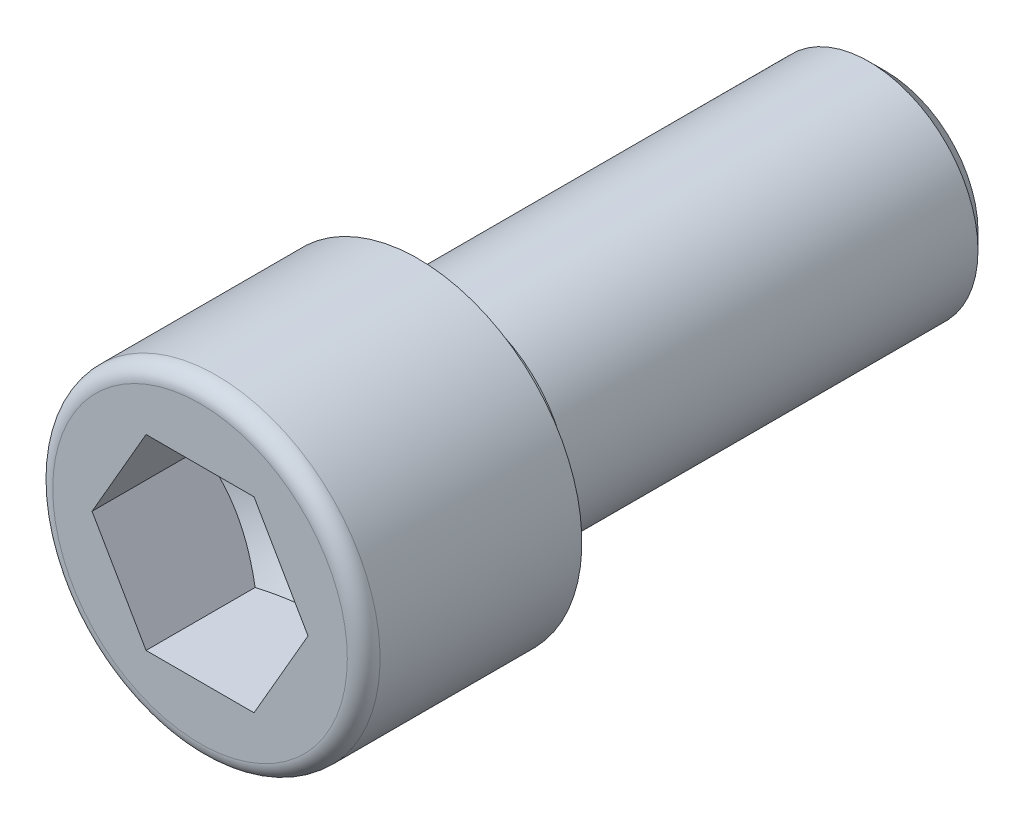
ISO-10303-21;
HEADER;
FILE_DESCRIPTION(('STEP AP214'),'2;1');
FILE_NAME('part.step','',(''),(''),'','','');
FILE_SCHEMA(('AUTOMOTIVE_DESIGN { 1 0 10303 214 1 1 1 1 }'));
ENDSEC;
DATA;
#1=APPLICATION_CONTEXT('core data for automotive mechanical design processes');
#2=APPLICATION_PROTOCOL_DEFINITION('international standard','automotive_design',2000,#1);
#3=PRODUCT_CONTEXT('',#1,'mechanical');
#4=PRODUCT('Part','Part','',(#3));
#5=PRODUCT_RELATED_PRODUCT_CATEGORY('part','',(#4));
#6=PRODUCT_DEFINITION_FORMATION('','',#4);
#7=PRODUCT_DEFINITION_CONTEXT('part definition',#1,'design');
#8=PRODUCT_DEFINITION('design','',#6,#7);
#9=PRODUCT_DEFINITION_SHAPE('','',#8);
#10=(LENGTH_UNIT() NAMED_UNIT(*) SI_UNIT(.MILLI.,.METRE.));
#11=(NAMED_UNIT(*) PLANE_ANGLE_UNIT() SI_UNIT($,.RADIAN.));
#12=(NAMED_UNIT(*) SI_UNIT($,.STERADIAN.) SOLID_ANGLE_UNIT());
#13=UNCERTAINTY_MEASURE_WITH_UNIT(LENGTH_MEASURE(1.E-05),#10,'distance_accuracy_value','');
#14=(GEOMETRIC_REPRESENTATION_CONTEXT(3) GLOBAL_UNCERTAINTY_ASSIGNED_CONTEXT((#13)) GLOBAL_UNIT_ASSIGNED_CONTEXT((#10,
#11,#12)) REPRESENTATION_CONTEXT('',''));
#15=CARTESIAN_POINT('',(0.,0.,0.));
#16=DIRECTION('',(0.,0.,1.));
#17=DIRECTION('',(1.,0.,0.));
#18=AXIS2_PLACEMENT_3D('',#15,#16,#17);
#19=CARTESIAN_POINT('',(0.,0.,7.02399999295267));
#20=DIRECTION('',(0.,0.,1.));
#21=DIRECTION('',(1.,0.,0.));
#22=AXIS2_PLACEMENT_3D('',#19,#20,#21);
#23=CONICAL_SURFACE('',#22,6.96976919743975,1.04719754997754);
#24=CARTESIAN_POINT('',(6.92820000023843,1.63961100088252E-09,7.00000000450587));
#25=CARTESIAN_POINT('',(6.85205600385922,0.13188527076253,6.95604672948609));
#26=CARTESIAN_POINT('',(6.77562810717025,0.264262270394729,6.9140883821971));
#27=CARTESIAN_POINT('',(6.62215164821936,0.53009129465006,6.83471096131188));
#28=CARTESIAN_POINT('',(6.54510283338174,0.663543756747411,6.79729384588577));
#29=CARTESIAN_POINT('',(6.31272282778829,1.06603773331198,6.6925888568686));
#30=CARTESIAN_POINT('',(6.15647438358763,1.3366679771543,6.63303478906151));
#31=CARTESIAN_POINT('',(5.92265144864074,1.74166118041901,6.5632022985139));
#32=CARTESIAN_POINT('',(5.84577552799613,1.87481418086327,6.54330937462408));
#33=CARTESIAN_POINT('',(5.69167637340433,2.14172174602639,6.50995264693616));
#34=CARTESIAN_POINT('',(5.61445317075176,2.27547625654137,6.49648827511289));
#35=CARTESIAN_POINT('',(5.45987268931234,2.5432175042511,6.47633179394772));
#36=CARTESIAN_POINT('',(5.38251566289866,2.67720380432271,6.46963199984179));
#37=CARTESIAN_POINT('',(5.22773447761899,2.9452926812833,6.46314114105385));
#38=CARTESIAN_POINT('',(5.15031032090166,3.07939525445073,6.4633498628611));
#39=CARTESIAN_POINT('',(4.93820667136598,3.44676955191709,6.47341714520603));
#40=CARTESIAN_POINT('',(4.80359665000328,3.67992094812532,6.49030895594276));
#41=CARTESIAN_POINT('',(4.53527065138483,4.14467521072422,6.54386725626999));
#42=CARTESIAN_POINT('',(4.40155561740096,4.37627644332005,6.58055204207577));
#43=CARTESIAN_POINT('',(4.13268985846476,4.8419655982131,6.67225109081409));
#44=CARTESIAN_POINT('',(3.99757304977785,5.07599477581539,6.72765377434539));
#45=CARTESIAN_POINT('',(3.72935411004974,5.54056360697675,6.8533946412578));
#46=CARTESIAN_POINT('',(3.59624854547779,5.77110920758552,6.92370329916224));
#47=CARTESIAN_POINT('',(3.46410000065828,5.99999720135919,7.00000000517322));
#48=B_SPLINE_CURVE_WITH_KNOTS('',3,(#24,#25,#26,#27,#28,#29,#30,#31,#32,#33,#34,#35,#36,#37,#38,
#39,#40,#41,#42,#43,#44,#45,#46,#47),.UNSPECIFIED.,.F.,.F.,(4,2,2,2,2,2,2,2,2,2,2,4),(0.,
0.475474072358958,0.951152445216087,1.90448541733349,2.36947707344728,2.8344276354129,
3.29884940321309,3.76325681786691,4.57165712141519,5.38080597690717,6.20789787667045,
7.03336654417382),.UNSPECIFIED.);
#49=CARTESIAN_POINT('',(6.92819999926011,0.,7.00000000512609));
#50=VERTEX_POINT('',#49);
#51=CARTESIAN_POINT('',(3.46409999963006,5.99999720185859,7.00000000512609));
#52=VERTEX_POINT('',#51);
#53=EDGE_CURVE('E118',#50,#52,#48,.T.);
#54=ORIENTED_EDGE('',*,*,#53,.T.);
#55=CARTESIAN_POINT('',(3.46409999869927,5.99999720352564,7.00000000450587));
#56=CARTESIAN_POINT('',(3.1797317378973,5.9999972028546,6.91790136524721));
#57=CARTESIAN_POINT('',(2.89311387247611,5.99999720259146,6.84273774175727));
#58=CARTESIAN_POINT('',(2.31522223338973,5.99999720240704,6.70989536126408));
#59=CARTESIAN_POINT('',(2.02393954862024,5.99999720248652,6.65225572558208));
#60=CARTESIAN_POINT('',(1.44464263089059,5.99999720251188,6.55956421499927));
#61=CARTESIAN_POINT('',(1.15670995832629,5.99999720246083,6.52401814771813));
#62=CARTESIAN_POINT('',(0.57918342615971,5.99999720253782,6.47629966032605));
#63=CARTESIAN_POINT('',(0.28959171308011,5.99999720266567,6.46410186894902));
#64=CARTESIAN_POINT('',(-0.28959171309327,5.99999720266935,6.46410186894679));
#65=CARTESIAN_POINT('',(-0.579183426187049,5.99999720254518,6.47629966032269));
#66=CARTESIAN_POINT('',(-1.15670995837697,5.99999720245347,6.52401814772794));
#67=CARTESIAN_POINT('',(-1.44464263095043,5.99999720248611,6.55956421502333));
#68=CARTESIAN_POINT('',(-2.02393954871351,5.9999972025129,6.65225572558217));
#69=CARTESIAN_POINT('',(-2.31522223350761,5.99999720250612,6.70989536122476));
#70=CARTESIAN_POINT('',(-2.89311387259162,5.99999720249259,6.8427377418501));
#71=CARTESIAN_POINT('',(-3.17973173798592,5.99999720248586,6.91790136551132));
#72=CARTESIAN_POINT('',(-3.46409999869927,5.99999720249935,7.00000000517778));
#73=B_SPLINE_CURVE_WITH_KNOTS('',3,(#55,#56,#57,#58,#59,#60,#61,#62,#63,#64,#65,#66,#67,#68,#69,
#70,#71,#72),.UNSPECIFIED.,.F.,.F.,(4,2,2,2,2,2,2,2,4),(0.,0.888219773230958,1.77840812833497,
2.64789134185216,3.51642919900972,4.38496705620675,5.25445026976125,6.14463862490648,
7.03285839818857),.UNSPECIFIED.);
#74=CARTESIAN_POINT('',(-3.46409999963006,5.99999720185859,7.00000000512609));
#75=VERTEX_POINT('',#74);
#76=EDGE_CURVE('E139',#52,#75,#73,.T.);
#77=ORIENTED_EDGE('',*,*,#76,.T.);
#78=CARTESIAN_POINT('',(-3.46410000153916,5.99999720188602,7.00000000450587));
#79=CARTESIAN_POINT('',(-3.54024399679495,5.8681119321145,6.95604672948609));
#80=CARTESIAN_POINT('',(-3.61667189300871,5.73573493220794,6.9140883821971));
#81=CARTESIAN_POINT('',(-3.77014835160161,5.46990590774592,6.83471096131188));
#82=CARTESIAN_POINT('',(-3.84719716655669,5.33645344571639,6.79729384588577));
#83=CARTESIAN_POINT('',(-4.0795771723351,4.93395946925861,6.6925888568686));
#84=CARTESIAN_POINT('',(-4.2358256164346,4.66332922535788,6.63303478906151));
#85=CARTESIAN_POINT('',(-4.46964855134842,4.25833602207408,6.5632022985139));
#86=CARTESIAN_POINT('',(-4.54652447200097,4.1251830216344,6.54330937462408));
#87=CARTESIAN_POINT('',(-4.70062362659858,3.85827545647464,6.50995264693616));
#88=CARTESIAN_POINT('',(-4.77784682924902,3.72452094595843,6.49648827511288));
#89=CARTESIAN_POINT('',(-4.93242731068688,3.4567796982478,6.47633179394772));
#90=CARTESIAN_POINT('',(-5.00978433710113,3.32279339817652,6.46963199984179));
#91=CARTESIAN_POINT('',(-5.16456552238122,3.05470452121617,6.46314114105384));
#92=CARTESIAN_POINT('',(-5.24198967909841,2.92060194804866,6.46334986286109));
#93=CARTESIAN_POINT('',(-5.4540933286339,2.55322765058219,6.47341714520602));
#94=CARTESIAN_POINT('',(-5.58870334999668,2.32007625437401,6.49030895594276));
#95=CARTESIAN_POINT('',(-5.85702934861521,1.85532199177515,6.54386725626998));
#96=CARTESIAN_POINT('',(-5.99074438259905,1.6237207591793,6.58055204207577));
#97=CARTESIAN_POINT('',(-6.25961014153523,1.15803160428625,6.67225109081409));
#98=CARTESIAN_POINT('',(-6.39472695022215,0.924002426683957,6.72765377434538));
#99=CARTESIAN_POINT('',(-6.66294588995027,0.459433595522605,6.8533946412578));
#100=CARTESIAN_POINT('',(-6.79605145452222,0.228887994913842,6.92370329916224));
#101=CARTESIAN_POINT('',(-6.92819999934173,1.14016237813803E-09,7.00000000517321));
#102=B_SPLINE_CURVE_WITH_KNOTS('',3,(#78,#79,#80,#81,#82,#83,#84,#85,#86,#87,#88,#89,#90,#91,
#92,#93,#94,#95,#96,#97,#98,#99,#100,#101),.UNSPECIFIED.,.F.,.F.,(4,2,2,2,2,2,2,2,2,2,2,4),(0.,
0.475474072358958,0.951152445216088,1.90448541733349,2.36947707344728,2.8344276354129,
3.29884940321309,3.76325681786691,4.57165712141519,5.38080597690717,6.20789787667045,
7.03336654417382),.UNSPECIFIED.);
#103=CARTESIAN_POINT('',(-6.92819999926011,0.,7.00000000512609));
#104=VERTEX_POINT('',#103);
#105=EDGE_CURVE('E146',#75,#104,#102,.T.);
#106=ORIENTED_EDGE('',*,*,#105,.T.);
#107=CARTESIAN_POINT('',(-6.92820000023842,-1.63960875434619E-09,7.00000000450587));
#108=CARTESIAN_POINT('',(-6.85205600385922,-0.131885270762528,6.95604672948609));
#109=CARTESIAN_POINT('',(-6.77562810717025,-0.264262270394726,6.9140883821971));
#110=CARTESIAN_POINT('',(-6.62215164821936,-0.530091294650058,6.83471096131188));
#111=CARTESIAN_POINT('',(-6.54510283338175,-0.66354375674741,6.79729384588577));
#112=CARTESIAN_POINT('',(-6.31272282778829,-1.06603773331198,6.6925888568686));
#113=CARTESIAN_POINT('',(-6.15647438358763,-1.3366679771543,6.63303478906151));
#114=CARTESIAN_POINT('',(-5.92265144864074,-1.74166118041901,6.5632022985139));
#115=CARTESIAN_POINT('',(-5.84577552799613,-1.87481418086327,6.54330937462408));
#116=CARTESIAN_POINT('',(-5.69167637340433,-2.14172174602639,6.50995264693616));
#117=CARTESIAN_POINT('',(-5.61445317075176,-2.27547625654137,6.49648827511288));
#118=CARTESIAN_POINT('',(-5.45987268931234,-2.5432175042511,6.47633179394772));
#119=CARTESIAN_POINT('',(-5.38251566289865,-2.67720380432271,6.46963199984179));
#120=CARTESIAN_POINT('',(-5.22773447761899,-2.9452926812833,6.46314114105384));
#121=CARTESIAN_POINT('',(-5.15031032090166,-3.07939525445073,6.46334986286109));
#122=CARTESIAN_POINT('',(-4.93820667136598,-3.44676955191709,6.47341714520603));
#123=CARTESIAN_POINT('',(-4.80359665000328,-3.67992094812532,6.49030895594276));
#124=CARTESIAN_POINT('',(-4.53527065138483,-4.14467521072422,6.54386725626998));
#125=CARTESIAN_POINT('',(-4.40155561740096,-4.37627644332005,6.58055204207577));
#126=CARTESIAN_POINT('',(-4.13268985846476,-4.8419655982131,6.67225109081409));
#127=CARTESIAN_POINT('',(-3.99757304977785,-5.07599477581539,6.72765377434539));
#128=CARTESIAN_POINT('',(-3.72935411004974,-5.54056360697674,6.8533946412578));
#129=CARTESIAN_POINT('',(-3.59624854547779,-5.77110920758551,6.92370329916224));
#130=CARTESIAN_POINT('',(-3.46410000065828,-5.99999720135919,7.00000000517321));
#131=B_SPLINE_CURVE_WITH_KNOTS('',3,(#107,#108,#109,#110,#111,#112,#113,#114,#115,#116,#117,
#118,#119,#120,#121,#122,#123,#124,#125,#126,#127,#128,#129,#130),.UNSPECIFIED.,.F.,.F.,(4,2,2,
2,2,2,2,2,2,2,2,4),(0.,0.475474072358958,0.951152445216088,1.90448541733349,2.36947707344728,
2.8344276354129,3.29884940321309,3.76325681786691,4.57165712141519,5.38080597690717,
6.20789787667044,7.03336654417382),.UNSPECIFIED.);
#132=CARTESIAN_POINT('',(-3.46409999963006,-5.99999720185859,7.00000000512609));
#133=VERTEX_POINT('',#132);
#134=EDGE_CURVE('E90',#104,#133,#131,.T.);
#135=ORIENTED_EDGE('',*,*,#134,.T.);
#136=CARTESIAN_POINT('',(-3.46409999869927,-5.99999720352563,7.00000000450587));
#137=CARTESIAN_POINT('',(-3.1797317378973,-5.9999972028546,6.91790136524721));
#138=CARTESIAN_POINT('',(-2.89311387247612,-5.99999720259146,6.84273774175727));
#139=CARTESIAN_POINT('',(-2.31522223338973,-5.99999720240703,6.70989536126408));
#140=CARTESIAN_POINT('',(-2.02393954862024,-5.99999720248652,6.65225572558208));
#141=CARTESIAN_POINT('',(-1.4446426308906,-5.99999720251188,6.55956421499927));
#142=CARTESIAN_POINT('',(-1.15670995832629,-5.99999720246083,6.52401814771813));
#143=CARTESIAN_POINT('',(-0.57918342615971,-5.99999720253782,6.47629966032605));
#144=CARTESIAN_POINT('',(-0.28959171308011,-5.99999720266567,6.46410186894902));
#145=CARTESIAN_POINT('',(0.28959171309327,-5.99999720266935,6.46410186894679));
#146=CARTESIAN_POINT('',(0.579183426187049,-5.99999720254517,6.47629966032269));
#147=CARTESIAN_POINT('',(1.15670995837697,-5.99999720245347,6.52401814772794));
#148=CARTESIAN_POINT('',(1.44464263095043,-5.99999720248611,6.55956421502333));
#149=CARTESIAN_POINT('',(2.02393954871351,-5.9999972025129,6.65225572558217));
#150=CARTESIAN_POINT('',(2.31522223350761,-5.99999720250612,6.70989536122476));
#151=CARTESIAN_POINT('',(2.89311387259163,-5.99999720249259,6.8427377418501));
#152=CARTESIAN_POINT('',(3.17973173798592,-5.99999720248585,6.91790136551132));
#153=CARTESIAN_POINT('',(3.46409999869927,-5.99999720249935,7.00000000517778));
#154=B_SPLINE_CURVE_WITH_KNOTS('',3,(#136,#137,#138,#139,#140,#141,#142,#143,#144,#145,#146,
#147,#148,#149,#150,#151,#152,#153),.UNSPECIFIED.,.F.,.F.,(4,2,2,2,2,2,2,2,4),(0.,
0.888219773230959,1.77840812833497,2.64789134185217,3.51642919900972,4.38496705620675,
5.25445026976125,6.14463862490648,7.03285839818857),.UNSPECIFIED.);
#155=CARTESIAN_POINT('',(3.46409999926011,-5.99999720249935,7.00000000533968));
#156=VERTEX_POINT('',#155);
#157=EDGE_CURVE('E82',#133,#156,#154,.T.);
#158=ORIENTED_EDGE('',*,*,#157,.T.);
#159=CARTESIAN_POINT('',(3.46410000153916,-5.99999720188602,7.00000000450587));
#160=CARTESIAN_POINT('',(3.54024399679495,-5.8681119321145,6.95604672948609));
#161=CARTESIAN_POINT('',(3.61667189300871,-5.73573493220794,6.9140883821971));
#162=CARTESIAN_POINT('',(3.77014835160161,-5.46990590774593,6.83471096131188));
#163=CARTESIAN_POINT('',(3.84719716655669,-5.3364534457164,6.79729384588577));
#164=CARTESIAN_POINT('',(4.0795771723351,-4.93395946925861,6.6925888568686));
#165=CARTESIAN_POINT('',(4.2358256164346,-4.66332922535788,6.63303478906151));
#166=CARTESIAN_POINT('',(4.46964855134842,-4.25833602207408,6.5632022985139));
#167=CARTESIAN_POINT('',(4.54652447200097,-4.1251830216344,6.54330937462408));
#168=CARTESIAN_POINT('',(4.70062362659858,-3.85827545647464,6.50995264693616));
#169=CARTESIAN_POINT('',(4.77784682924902,-3.72452094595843,6.49648827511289));
#170=CARTESIAN_POINT('',(4.93242731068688,-3.4567796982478,6.47633179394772));
#171=CARTESIAN_POINT('',(5.00978433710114,-3.32279339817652,6.46963199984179));
#172=CARTESIAN_POINT('',(5.16456552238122,-3.05470452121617,6.46314114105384));
#173=CARTESIAN_POINT('',(5.24198967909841,-2.92060194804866,6.46334986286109));
#174=CARTESIAN_POINT('',(5.4540933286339,-2.55322765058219,6.47341714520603));
#175=CARTESIAN_POINT('',(5.58870334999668,-2.32007625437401,6.49030895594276));
#176=CARTESIAN_POINT('',(5.85702934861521,-1.85532199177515,6.54386725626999));
#177=CARTESIAN_POINT('',(5.99074438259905,-1.6237207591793,6.58055204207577));
#178=CARTESIAN_POINT('',(6.25961014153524,-1.15803160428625,6.67225109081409));
#179=CARTESIAN_POINT('',(6.39472695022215,-0.924002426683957,6.72765377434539));
#180=CARTESIAN_POINT('',(6.66294588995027,-0.459433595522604,6.8533946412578));
#181=CARTESIAN_POINT('',(6.79605145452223,-0.228887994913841,6.92370329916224));
#182=CARTESIAN_POINT('',(6.92819999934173,-1.14016173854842E-09,7.00000000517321));
#183=B_SPLINE_CURVE_WITH_KNOTS('',3,(#159,#160,#161,#162,#163,#164,#165,#166,#167,#168,#169,
#170,#171,#172,#173,#174,#175,#176,#177,#178,#179,#180,#181,#182),.UNSPECIFIED.,.F.,.F.,(4,2,2,
2,2,2,2,2,2,2,2,4),(0.,0.475474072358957,0.951152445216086,1.90448541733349,2.36947707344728,
2.8344276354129,3.29884940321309,3.76325681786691,4.57165712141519,5.38080597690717,
6.20789787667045,7.03336654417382),.UNSPECIFIED.);
#184=EDGE_CURVE('E87',#156,#50,#183,.T.);
#185=ORIENTED_EDGE('',*,*,#184,.T.);
#186=EDGE_LOOP('',(#54,#77,#106,#135,#158,#185));
#187=FACE_BOUND('',#186,.T.);
#188=CARTESIAN_POINT('',(0.,1.4210854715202E-10,3.0000018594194));
#189=VERTEX_POINT('',#188);
#190=VERTEX_LOOP('',#189);
#191=FACE_BOUND('',#190,.T.);
#192=ADVANCED_FACE('F16',(#187,#191),#23,.F.);
#193=CARTESIAN_POINT('',(-3.46410000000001,-5.99999720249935,14.));
#194=DIRECTION('',(0.,-1.,0.));
#195=DIRECTION('',(0.,0.,-1.));
#196=AXIS2_PLACEMENT_3D('',#193,#194,#195);
#197=PLANE('',#196);
#198=ORIENTED_EDGE('',*,*,#157,.F.);
#199=DIRECTION('',(0.,0.,1.));
#200=VECTOR('',#199,1.);
#201=CARTESIAN_POINT('',(-3.4641,-5.99999720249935,14.));
#202=LINE('',#201,#200);
#203=CARTESIAN_POINT('',(-3.4641,-5.99999720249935,14.));
#204=VERTEX_POINT('',#203);
#205=EDGE_CURVE('E93',#133,#204,#202,.T.);
#206=ORIENTED_EDGE('',*,*,#205,.T.);
#207=DIRECTION('',(1.,0.,0.));
#208=VECTOR('',#207,1.);
#209=CARTESIAN_POINT('',(0.,-5.99999720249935,14.));
#210=LINE('',#209,#208);
#211=CARTESIAN_POINT('',(3.4641,-5.99999720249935,14.));
#212=VERTEX_POINT('',#211);
#213=EDGE_CURVE('E99',#212,#204,#210,.F.);
#214=ORIENTED_EDGE('',*,*,#213,.F.);
#215=DIRECTION('',(0.,0.,1.));
#216=VECTOR('',#215,1.);
#217=CARTESIAN_POINT('',(3.4641,-5.99999720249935,14.));
#218=LINE('',#217,#216);
#219=EDGE_CURVE('E96',#212,#156,#218,.F.);
#220=ORIENTED_EDGE('',*,*,#219,.T.);
#221=EDGE_LOOP('',(#198,#206,#214,#220));
#222=FACE_BOUND('',#221,.T.);
#223=ADVANCED_FACE('F97',(#222),#197,.F.);
#224=CARTESIAN_POINT('',(-6.9282,0.,14.));
#225=DIRECTION('',(-0.866025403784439,-0.5,0.));
#226=DIRECTION('',(0.5,-0.866025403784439,0.));
#227=AXIS2_PLACEMENT_3D('',#224,#225,#226);
#228=PLANE('',#227);
#229=DIRECTION('',(0.,0.,1.));
#230=VECTOR('',#229,1.);
#231=CARTESIAN_POINT('',(-6.9282,0.,14.));
#232=LINE('',#231,#230);
#233=CARTESIAN_POINT('',(-6.9282,0.,14.));
#234=VERTEX_POINT('',#233);
#235=EDGE_CURVE('E154',#104,#234,#232,.T.);
#236=ORIENTED_EDGE('',*,*,#235,.T.);
#237=DIRECTION('',(-0.5,0.866025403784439,0.));
#238=VECTOR('',#237,1.);
#239=CARTESIAN_POINT('',(-3.46410000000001,-5.99999720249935,14.));
#240=LINE('',#239,#238);
#241=EDGE_CURVE('E107',#204,#234,#240,.T.);
#242=ORIENTED_EDGE('',*,*,#241,.F.);
#243=ORIENTED_EDGE('',*,*,#205,.F.);
#244=ORIENTED_EDGE('',*,*,#134,.F.);
#245=EDGE_LOOP('',(#236,#242,#243,#244));
#246=FACE_BOUND('',#245,.T.);
#247=ADVANCED_FACE('F155',(#246),#228,.F.);
#248=CARTESIAN_POINT('',(-3.4641,5.99999720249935,14.));
#249=DIRECTION('',(-0.866025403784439,0.5,0.));
#250=DIRECTION('',(-0.5,-0.866025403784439,0.));
#251=AXIS2_PLACEMENT_3D('',#248,#249,#250);
#252=PLANE('',#251);
#253=DIRECTION('',(0.,0.,1.));
#254=VECTOR('',#253,1.);
#255=CARTESIAN_POINT('',(-3.4641,5.99999720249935,14.));
#256=LINE('',#255,#254);
#257=CARTESIAN_POINT('',(-3.4641,5.99999720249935,14.));
#258=VERTEX_POINT('',#257);
#259=EDGE_CURVE('E337',#75,#258,#256,.T.);
#260=ORIENTED_EDGE('',*,*,#259,.T.);
#261=DIRECTION('',(0.5,0.866025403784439,0.));
#262=VECTOR('',#261,1.);
#263=CARTESIAN_POINT('',(-6.9282,0.,14.));
#264=LINE('',#263,#262);
#265=EDGE_CURVE('E268',#234,#258,#264,.T.);
#266=ORIENTED_EDGE('',*,*,#265,.F.);
#267=ORIENTED_EDGE('',*,*,#235,.F.);
#268=ORIENTED_EDGE('',*,*,#105,.F.);
#269=EDGE_LOOP('',(#260,#266,#267,#268));
#270=FACE_BOUND('',#269,.T.);
#271=ADVANCED_FACE('F158',(#270),#252,.F.);
#272=CARTESIAN_POINT('',(3.4641,5.99999720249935,14.));
#273=DIRECTION('',(0.,1.,0.));
#274=DIRECTION('',(0.,0.,1.));
#275=AXIS2_PLACEMENT_3D('',#272,#273,#274);
#276=PLANE('',#275);
#277=ORIENTED_EDGE('',*,*,#76,.F.);
#278=DIRECTION('',(0.,0.,1.));
#279=VECTOR('',#278,1.);
#280=CARTESIAN_POINT('',(3.4641,5.99999720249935,14.));
#281=LINE('',#280,#279);
#282=CARTESIAN_POINT('',(3.4641,5.99999720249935,14.));
#283=VERTEX_POINT('',#282);
#284=EDGE_CURVE('E333',#52,#283,#281,.T.);
#285=ORIENTED_EDGE('',*,*,#284,.T.);
#286=DIRECTION('',(1.,0.,0.));
#287=VECTOR('',#286,1.);
#288=CARTESIAN_POINT('',(0.,5.99999720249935,14.));
#289=LINE('',#288,#287);
#290=EDGE_CURVE('E263',#258,#283,#289,.T.);
#291=ORIENTED_EDGE('',*,*,#290,.F.);
#292=ORIENTED_EDGE('',*,*,#259,.F.);
#293=EDGE_LOOP('',(#277,#285,#291,#292));
#294=FACE_BOUND('',#293,.T.);
#295=ADVANCED_FACE('F162',(#294),#276,.F.);
#296=CARTESIAN_POINT('',(6.9282,0.,14.));
#297=DIRECTION('',(0.866025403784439,0.5,0.));
#298=DIRECTION('',(-0.5,0.866025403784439,0.));
#299=AXIS2_PLACEMENT_3D('',#296,#297,#298);
#300=PLANE('',#299);
#301=DIRECTION('',(0.,0.,1.));
#302=VECTOR('',#301,1.);
#303=CARTESIAN_POINT('',(6.9282,0.,14.));
#304=LINE('',#303,#302);
#305=CARTESIAN_POINT('',(6.9282,0.,14.));
#306=VERTEX_POINT('',#305);
#307=EDGE_CURVE('E103',#50,#306,#304,.T.);
#308=ORIENTED_EDGE('',*,*,#307,.T.);
#309=DIRECTION('',(0.5,-0.866025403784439,0.));
#310=VECTOR('',#309,1.);
#311=CARTESIAN_POINT('',(3.4641,5.99999720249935,14.));
#312=LINE('',#311,#310);
#313=EDGE_CURVE('E258',#283,#306,#312,.T.);
#314=ORIENTED_EDGE('',*,*,#313,.F.);
#315=ORIENTED_EDGE('',*,*,#284,.F.);
#316=ORIENTED_EDGE('',*,*,#53,.F.);
#317=EDGE_LOOP('',(#308,#314,#315,#316));
#318=FACE_BOUND('',#317,.T.);
#319=ADVANCED_FACE('F166',(#318),#300,.F.);
#320=CARTESIAN_POINT('',(3.4641,-5.99999720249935,14.));
#321=DIRECTION('',(0.866025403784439,-0.5,0.));
#322=DIRECTION('',(0.5,0.866025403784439,0.));
#323=AXIS2_PLACEMENT_3D('',#320,#321,#322);
#324=PLANE('',#323);
#325=ORIENTED_EDGE('',*,*,#219,.F.);
#326=DIRECTION('',(-0.5,-0.866025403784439,0.));
#327=VECTOR('',#326,1.);
#328=CARTESIAN_POINT('',(6.9282,0.,14.));
#329=LINE('',#328,#327);
#330=EDGE_CURVE('E256',#306,#212,#329,.T.);
#331=ORIENTED_EDGE('',*,*,#330,.F.);
#332=ORIENTED_EDGE('',*,*,#307,.F.);
#333=ORIENTED_EDGE('',*,*,#184,.F.);
#334=EDGE_LOOP('',(#325,#331,#332,#333));
#335=FACE_BOUND('',#334,.T.);
#336=ADVANCED_FACE('F105',(#335),#324,.F.);
#337=CARTESIAN_POINT('',(0.,4.725,14.));
#338=DIRECTION('',(0.,0.,1.));
#339=DIRECTION('',(1.,0.,0.));
#340=AXIS2_PLACEMENT_3D('',#337,#338,#339);
#341=PLANE('',#340);
#342=ORIENTED_EDGE('',*,*,#313,.T.);
#343=ORIENTED_EDGE('',*,*,#330,.T.);
#344=ORIENTED_EDGE('',*,*,#213,.T.);
#345=ORIENTED_EDGE('',*,*,#241,.T.);
#346=ORIENTED_EDGE('',*,*,#265,.T.);
#347=ORIENTED_EDGE('',*,*,#290,.T.);
#348=EDGE_LOOP('',(#342,#343,#344,#345,#346,#347));
#349=FACE_BOUND('',#348,.T.);
#350=CARTESIAN_POINT('',(0.,0.,14.));
#351=DIRECTION('',(0.,0.,-1.));
#352=DIRECTION('',(-1.,0.,0.));
#353=AXIS2_PLACEMENT_3D('',#350,#351,#352);
#354=CIRCLE('',#353,9.45);
#355=CARTESIAN_POINT('',(-9.45,0.,14.));
#356=VERTEX_POINT('',#355);
#357=CARTESIAN_POINT('',(0.,9.45,14.));
#358=VERTEX_POINT('',#357);
#359=EDGE_CURVE('E245',#356,#358,#354,.T.);
#360=ORIENTED_EDGE('',*,*,#359,.F.);
#361=CARTESIAN_POINT('',(0.,0.,14.));
#362=DIRECTION('',(0.,0.,-1.));
#363=DIRECTION('',(1.,0.,0.));
#364=AXIS2_PLACEMENT_3D('',#361,#362,#363);
#365=CIRCLE('',#364,9.45);
#366=CARTESIAN_POINT('',(9.45,0.,14.));
#367=VERTEX_POINT('',#366);
#368=EDGE_CURVE('E37',#367,#356,#365,.T.);
#369=ORIENTED_EDGE('',*,*,#368,.F.);
#370=CARTESIAN_POINT('',(0.,0.,14.));
#371=DIRECTION('',(0.,0.,-1.));
#372=DIRECTION('',(0.,1.,0.));
#373=AXIS2_PLACEMENT_3D('',#370,#371,#372);
#374=CIRCLE('',#373,9.45);
#375=EDGE_CURVE('E234',#358,#367,#374,.T.);
#376=ORIENTED_EDGE('',*,*,#375,.F.);
#377=EDGE_LOOP('',(#360,#369,#376));
#378=FACE_BOUND('',#377,.T.);
#379=ADVANCED_FACE('F174',(#349,#378),#341,.T.);
#380=CARTESIAN_POINT('',(0.,0.,12.95));
#381=DIRECTION('',(0.,0.,-1.));
#382=DIRECTION('',(-1.,0.,0.));
#383=AXIS2_PLACEMENT_3D('',#380,#381,#382);
#384=TOROIDAL_SURFACE('',#383,9.45,1.05);
#385=ORIENTED_EDGE('',*,*,#368,.T.);
#386=ORIENTED_EDGE('',*,*,#359,.T.);
#387=ORIENTED_EDGE('',*,*,#375,.T.);
#388=EDGE_LOOP('',(#385,#386,#387));
#389=FACE_BOUND('',#388,.T.);
#390=CARTESIAN_POINT('',(0.,0.,12.95));
#391=DIRECTION('',(0.,0.,-1.));
#392=DIRECTION('',(-1.,0.,0.));
#393=AXIS2_PLACEMENT_3D('',#390,#391,#392);
#394=CIRCLE('',#393,10.5);
#395=CARTESIAN_POINT('',(-10.5,0.,12.95));
#396=VERTEX_POINT('',#395);
#397=EDGE_CURVE('E231',#396,#396,#394,.T.);
#398=ORIENTED_EDGE('',*,*,#397,.F.);
#399=EDGE_LOOP('',(#398));
#400=FACE_BOUND('',#399,.T.);
#401=ADVANCED_FACE('F208',(#389,#400),#384,.T.);
#402=CARTESIAN_POINT('',(0.,0.,6.475));
#403=DIRECTION('',(0.,0.,-1.));
#404=DIRECTION('',(-1.,0.,0.));
#405=AXIS2_PLACEMENT_3D('',#402,#403,#404);
#406=CYLINDRICAL_SURFACE('',#405,10.5);
#407=CARTESIAN_POINT('',(0.,0.,0.));
#408=DIRECTION('',(0.,0.,-1.));
#409=DIRECTION('',(-1.,0.,0.));
#410=AXIS2_PLACEMENT_3D('',#407,#408,#409);
#411=CIRCLE('',#410,10.5);
#412=CARTESIAN_POINT('',(-10.5,0.,0.));
#413=VERTEX_POINT('',#412);
#414=EDGE_CURVE('E116',#413,#413,#411,.T.);
#415=ORIENTED_EDGE('',*,*,#414,.F.);
#416=EDGE_LOOP('',(#415));
#417=FACE_BOUND('',#416,.T.);
#418=ORIENTED_EDGE('',*,*,#397,.T.);
#419=EDGE_LOOP('',(#418));
#420=FACE_BOUND('',#419,.T.);
#421=ADVANCED_FACE('F205',(#417,#420),#406,.T.);
#422=CARTESIAN_POINT('',(0.,9.1,0.));
#423=DIRECTION('',(0.,0.,-1.));
#424=DIRECTION('',(-1.,0.,0.));
#425=AXIS2_PLACEMENT_3D('',#422,#423,#424);
#426=PLANE('',#425);
#427=CARTESIAN_POINT('',(0.,0.,0.));
#428=DIRECTION('',(0.,0.,-1.));
#429=DIRECTION('',(-1.,0.,0.));
#430=AXIS2_PLACEMENT_3D('',#427,#428,#429);
#431=CIRCLE('',#430,7.7);
#432=CARTESIAN_POINT('',(-7.7,0.,0.));
#433=VERTEX_POINT('',#432);
#434=EDGE_CURVE('E226',#433,#433,#431,.T.);
#435=ORIENTED_EDGE('',*,*,#434,.F.);
#436=EDGE_LOOP('',(#435));
#437=FACE_BOUND('',#436,.T.);
#438=ORIENTED_EDGE('',*,*,#414,.T.);
#439=EDGE_LOOP('',(#438));
#440=FACE_BOUND('',#439,.T.);
#441=ADVANCED_FACE('F202',(#437,#440),#426,.T.);
#442=CARTESIAN_POINT('',(0.,0.,-0.7));
#443=DIRECTION('',(0.,0.,-1.));
#444=DIRECTION('',(-1.,0.,0.));
#445=AXIS2_PLACEMENT_3D('',#442,#443,#444);
#446=TOROIDAL_SURFACE('',#445,7.7,0.700000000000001);
#447=CARTESIAN_POINT('',(0.,0.,-0.7));
#448=DIRECTION('',(0.,0.,-1.));
#449=DIRECTION('',(-1.,0.,0.));
#450=AXIS2_PLACEMENT_3D('',#447,#448,#449);
#451=CIRCLE('',#450,7.);
#452=CARTESIAN_POINT('',(-7.,0.,-0.7));
#453=VERTEX_POINT('',#452);
#454=EDGE_CURVE('E223',#453,#453,#451,.T.);
#455=ORIENTED_EDGE('',*,*,#454,.F.);
#456=EDGE_LOOP('',(#455));
#457=FACE_BOUND('',#456,.T.);
#458=ORIENTED_EDGE('',*,*,#434,.T.);
#459=EDGE_LOOP('',(#458));
#460=FACE_BOUND('',#459,.T.);
#461=ADVANCED_FACE('F18',(#457,#460),#446,.F.);
#462=CARTESIAN_POINT('',(0.,0.,-0.700499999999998));
#463=DIRECTION('',(0.,0.,-1.));
#464=DIRECTION('',(-1.,0.,0.));
#465=AXIS2_PLACEMENT_3D('',#462,#463,#464);
#466=CYLINDRICAL_SURFACE('',#465,7.);
#467=CARTESIAN_POINT('',(0.,0.,-0.700999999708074));
#468=DIRECTION('',(0.,0.,1.));
#469=DIRECTION('',(0.,1.,0.));
#470=AXIS2_PLACEMENT_3D('',#467,#468,#469);
#471=CIRCLE('',#470,6.99999999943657);
#472=CARTESIAN_POINT('',(0.,6.99999999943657,-0.700999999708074));
#473=VERTEX_POINT('',#472);
#474=EDGE_CURVE('E225',#473,#473,#471,.F.);
#475=ORIENTED_EDGE('',*,*,#474,.F.);
#476=EDGE_LOOP('',(#475));
#477=FACE_BOUND('',#476,.T.);
#478=ORIENTED_EDGE('',*,*,#454,.T.);
#479=EDGE_LOOP('',(#478));
#480=FACE_BOUND('',#479,.T.);
#481=ADVANCED_FACE('F197',(#477,#480),#466,.T.);
#482=CARTESIAN_POINT('',(0.,0.,-0.700999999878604));
#483=DIRECTION('',(0.,0.,1.));
#484=DIRECTION('',(1.,0.,0.));
#485=AXIS2_PLACEMENT_3D('',#482,#483,#484);
#486=CONICAL_SURFACE('',#485,6.99999999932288,0.523598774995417);
#487=CARTESIAN_POINT('',(0.,0.,-2.57594499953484));
#488=DIRECTION('',(0.,0.,1.));
#489=DIRECTION('',(1.,0.,0.));
#490=AXIS2_PLACEMENT_3D('',#487,#488,#489);
#491=CIRCLE('',#490,5.91750000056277);
#492=CARTESIAN_POINT('',(5.91750000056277,0.,-2.57594499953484));
#493=VERTEX_POINT('',#492);
#494=EDGE_CURVE('E230',#493,#493,#491,.F.);
#495=ORIENTED_EDGE('',*,*,#494,.F.);
#496=EDGE_LOOP('',(#495));
#497=FACE_BOUND('',#496,.T.);
#498=ORIENTED_EDGE('',*,*,#474,.T.);
#499=EDGE_LOOP('',(#498));
#500=FACE_BOUND('',#499,.T.);
#501=ADVANCED_FACE('F193',(#497,#500),#486,.T.);
#502=CARTESIAN_POINT('',(0.,2.95875,-30.));
#503=DIRECTION('',(0.,0.,-1.));
#504=DIRECTION('',(-1.,0.,0.));
#505=AXIS2_PLACEMENT_3D('',#502,#503,#504);
#506=PLANE('',#505);
#507=CARTESIAN_POINT('',(0.,0.,-30.0000000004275));
#508=DIRECTION('',(0.,0.,1.));
#509=DIRECTION('',(1.,0.,0.));
#510=AXIS2_PLACEMENT_3D('',#507,#508,#509);
#511=CIRCLE('',#510,5.91750000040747);
#512=CARTESIAN_POINT('',(5.91750000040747,0.,-30.0000000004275));
#513=VERTEX_POINT('',#512);
#514=EDGE_CURVE('E280',#513,#513,#511,.T.);
#515=ORIENTED_EDGE('',*,*,#514,.F.);
#516=EDGE_LOOP('',(#515));
#517=FACE_BOUND('',#516,.T.);
#518=ADVANCED_FACE('F189',(#517),#506,.T.);
#519=CARTESIAN_POINT('',(0.,6.45875,-2.57594499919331));
#520=DIRECTION('',(0.,0.,1.));
#521=DIRECTION('',(1.,0.,0.));
#522=AXIS2_PLACEMENT_3D('',#519,#520,#521);
#523=PLANE('',#522);
#524=ORIENTED_EDGE('',*,*,#494,.T.);
#525=EDGE_LOOP('',(#524));
#526=FACE_BOUND('',#525,.T.);
#527=CARTESIAN_POINT('',(0.,0.,-2.57594499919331));
#528=DIRECTION('',(0.,0.,-1.));
#529=DIRECTION('',(-1.,0.,0.));
#530=AXIS2_PLACEMENT_3D('',#527,#528,#529);
#531=CIRCLE('',#530,7.);
#532=CARTESIAN_POINT('',(-7.,0.,-2.57594499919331));
#533=VERTEX_POINT('',#532);
#534=EDGE_CURVE('E28',#533,#533,#531,.T.);
#535=ORIENTED_EDGE('',*,*,#534,.F.);
#536=EDGE_LOOP('',(#535));
#537=FACE_BOUND('',#536,.T.);
#538=ADVANCED_FACE('F181',(#526,#537),#523,.T.);
#539=CARTESIAN_POINT('',(0.,0.,-28.9174999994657));
#540=DIRECTION('',(0.,0.,1.));
#541=DIRECTION('',(1.,0.,0.));
#542=AXIS2_PLACEMENT_3D('',#539,#540,#541);
#543=CONICAL_SURFACE('',#542,6.99999999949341,0.785398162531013);
#544=ORIENTED_EDGE('',*,*,#514,.T.);
#545=EDGE_LOOP('',(#544));
#546=FACE_BOUND('',#545,.T.);
#547=CARTESIAN_POINT('',(0.,0.,-28.9175));
#548=DIRECTION('',(0.,0.,-1.));
#549=DIRECTION('',(-1.,0.,0.));
#550=AXIS2_PLACEMENT_3D('',#547,#548,#549);
#551=CIRCLE('',#550,7.);
#552=CARTESIAN_POINT('',(-7.,0.,-28.9175));
#553=VERTEX_POINT('',#552);
#554=EDGE_CURVE('E10',#553,#553,#551,.F.);
#555=ORIENTED_EDGE('',*,*,#554,.F.);
#556=EDGE_LOOP('',(#555));
#557=FACE_BOUND('',#556,.T.);
#558=ADVANCED_FACE('F177',(#546,#557),#543,.T.);
#559=CARTESIAN_POINT('',(0.,0.,-15.7467224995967));
#560=DIRECTION('',(0.,0.,-1.));
#561=DIRECTION('',(-1.,0.,0.));
#562=AXIS2_PLACEMENT_3D('',#559,#560,#561);
#563=CYLINDRICAL_SURFACE('',#562,7.);
#564=ORIENTED_EDGE('',*,*,#534,.T.);
#565=EDGE_LOOP('',(#564));
#566=FACE_BOUND('',#565,.T.);
#567=ORIENTED_EDGE('',*,*,#554,.T.);
#568=EDGE_LOOP('',(#567));
#569=FACE_BOUND('',#568,.T.);
#570=ADVANCED_FACE('F175',(#566,#569),#563,.T.);
#571=CLOSED_SHELL('',(#192,#223,#247,#271,#295,#319,#336,#379,#401,#421,#441,#461,#481,#501,
#518,#538,#558,#570));
#572=MANIFOLD_SOLID_BREP('B1',#571);
#573=ADVANCED_BREP_SHAPE_REPRESENTATION('',(#18,#572),#14);
#574=SHAPE_DEFINITION_REPRESENTATION(#9,#573);
ENDSEC;
END-ISO-10303-21;
